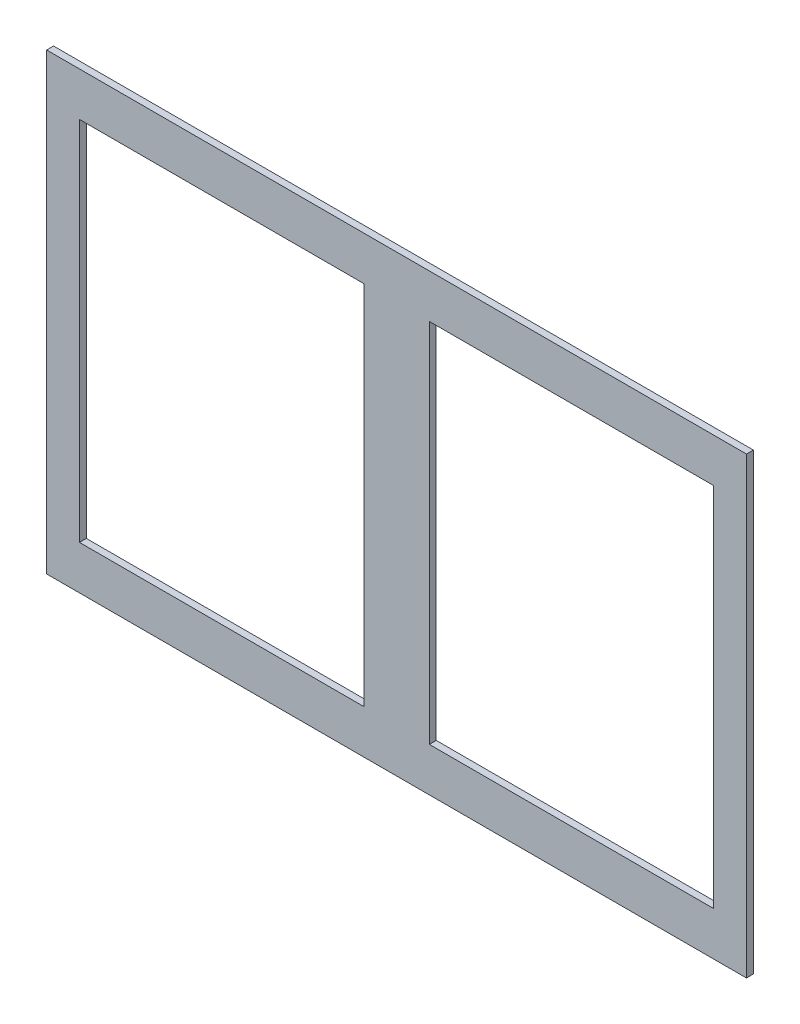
from build123d import *

# Parameters (mm, degrees)
SKETCH1_W           = 812.8
SKETCH1_H           = 1054.1
SKETCH1_W_2         = 660.4
SKETCH1_H_2         = 850.9
BOSS_EXTRUDE1_DEPTH = 16


with BuildPart() as part:
    # Sketch1 → Boss-Extrude1 (new body)
    # profile 1 of 2: a face of its own
    with BuildSketch(Plane.XY):
        Rectangle(SKETCH1_W, SKETCH1_H)
        Rectangle(SKETCH1_W_2, SKETCH1_H_2, mode=Mode.SUBTRACT)
    # profile 2 of 2: a face of its own
    with BuildSketch(Plane.XY):
        with Locations((812.8, 0)):
            Rectangle(SKETCH1_W, SKETCH1_H)
        with Locations((812.8, 0)):
            Rectangle(SKETCH1_W_2, SKETCH1_H_2, mode=Mode.SUBTRACT)
    extrude(amount=BOSS_EXTRUDE1_DEPTH)


solid = part.part
